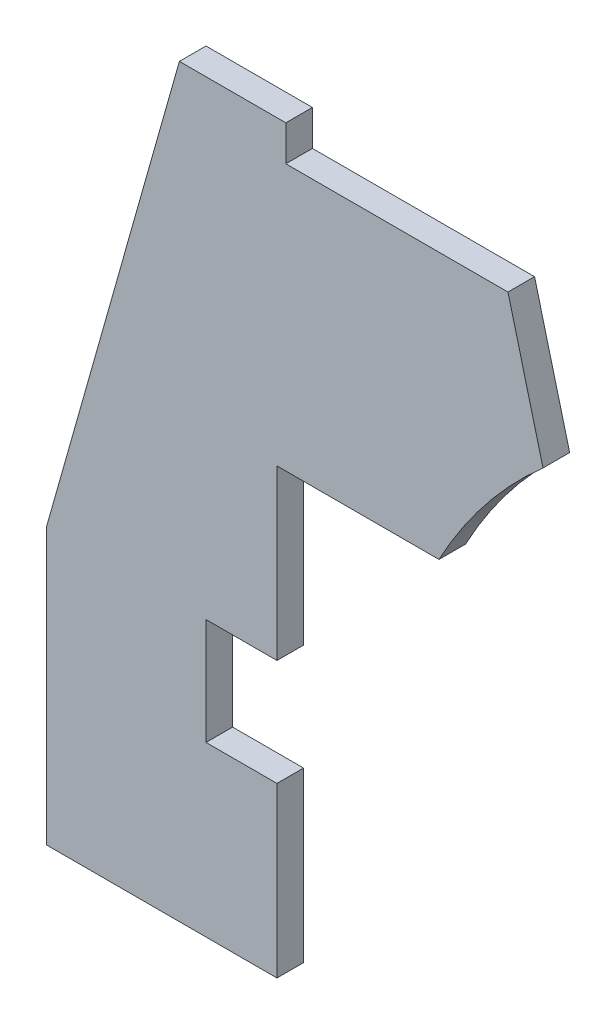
from build123d import *

# Parameters (mm, degrees)
EXTRUSION1_DEPTH = 15


with BuildPart() as part:
    # Esquisse1 → Extrusion1 (new body)
    with BuildSketch(Plane.XY):
        with BuildLine():
            Line((0, 155), (0, 0))
            Line((0, 0), (130, 0))
            Line((130, 0), (130, 95))
            Line((130, 95), (90, 95))
            Line((90, 95), (90, 155))
            Line((90, 155), (130, 155))
            Line((130, 155), (130, 250))
            Line((130, 250), (221.333571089, 250))
            ThreePointArc((221.333571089, 250), (247.344107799, 289.633017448), (280, 323.997487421))
            Line((280, 323.997487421), (260.208197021, 400))
            Line((260.208197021, 400), (135, 400))
            Line((135, 400), (135, 420))
            Line((135, 420), (75, 420))
            Line((75, 420), (0, 155))
        make_face()
    extrude(amount=EXTRUSION1_DEPTH)


solid = part.part
